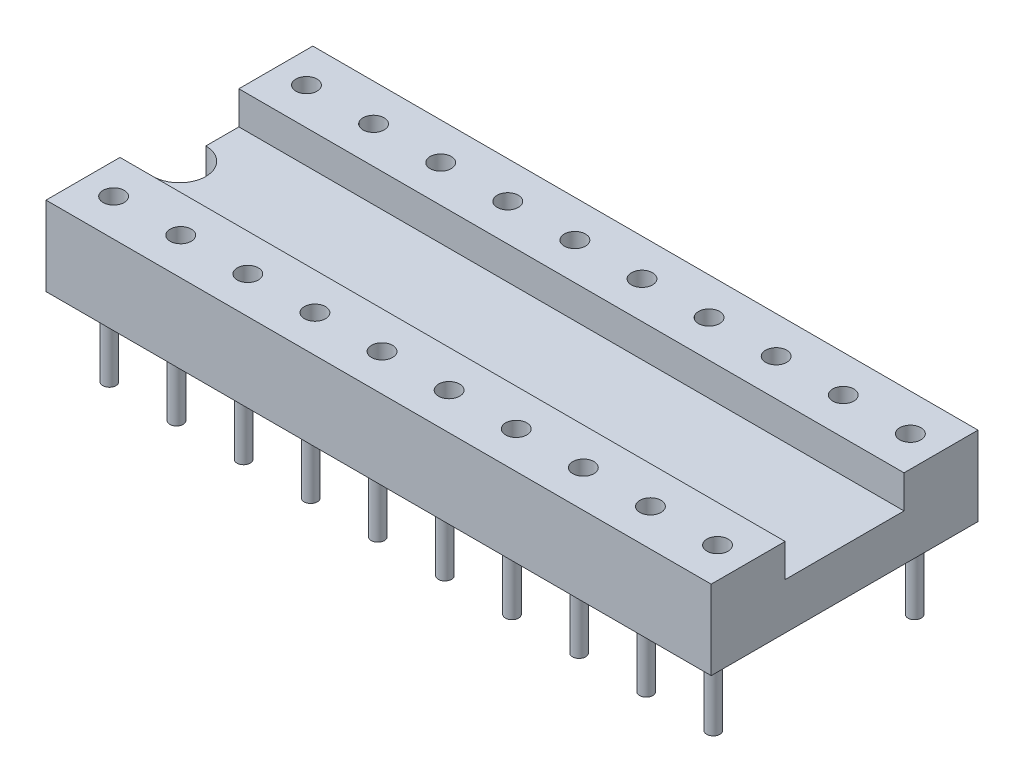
from build123d import *

# Parameters (mm, degrees)
EXTRUSION1_DEPTH        = 25.18
ENL_V_MAT_EXTRU_1_DEPTH = 26.740967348
ESQUISSE3_R             = 0.4
ENL_V_MAT_EXTRU_2_DEPTH = 2.5
ESQUISSE5_R             = 0.25
EXTRUSION2_DEPTH        = 3


with BuildPart() as part:
    # Esquisse1 → Extrusion1 (new body)
    with BuildSketch(Plane(origin=(0, 0, 0), x_dir=(0, 0, -1), z_dir=(1, 0, 0))):
        Polygon((-2.25, 1.75), (-2.25, 3), (-5.05, 3), (-5.05, 0), (5.05, 0), (5.05, 3), (2.25, 3), (2.25, 1.75), align=None)
    extrude(amount=EXTRUSION1_DEPTH)

    # Esquisse2 → Enl_v. mat.-Extru.1 (cut, through all)
    with BuildSketch(Plane(origin=(0, 1.75, 0), x_dir=(-1, 0, 0), z_dir=(0, 1, 0))):
        with BuildLine():
            Line((0, -1), (0, 1))
            ThreePointArc((0, 1), (-1, 0), (0, -1))
        make_face()
    extrude(amount=-ENL_V_MAT_EXTRU_1_DEPTH, mode=Mode.SUBTRACT)

    # Esquisse3 → Enl_v. mat.-Extru.2 (cut)
    with BuildSketch(Plane(origin=(0, 3, 0), x_dir=(-1, 0, 0), z_dir=(0, 1, 0))):
        with Locations(Location((-1.16, 3.65, 0), (0, 0, 90))):
            Circle(ESQUISSE3_R)
        with Locations(Location((-1.16, -3.65, 0), (0, 0, 270))):
            Circle(ESQUISSE3_R)
        with Locations(Location((-3.7, 3.65, 0), (0, 0, 90))):
            Circle(ESQUISSE3_R)
        with Locations(Location((-3.7, -3.65, 0), (0, 0, 270))):
            Circle(ESQUISSE3_R)
        with Locations(Location((-6.24, 3.65, 0), (0, 0, 90))):
            Circle(ESQUISSE3_R)
        with Locations(Location((-6.24, -3.65, 0), (0, 0, 270))):
            Circle(ESQUISSE3_R)
        with Locations(Location((-8.78, 3.65, 0), (0, 0, 90))):
            Circle(ESQUISSE3_R)
        with Locations(Location((-8.78, -3.65, 0), (0, 0, 270))):
            Circle(ESQUISSE3_R)
        with Locations(Location((-11.32, 3.65, 0), (0, 0, 90))):
            Circle(ESQUISSE3_R)
        with Locations(Location((-11.32, -3.65, 0), (0, 0, 270))):
            Circle(ESQUISSE3_R)
        with Locations(Location((-13.86, 3.65, 0), (0, 0, 90))):
            Circle(ESQUISSE3_R)
        with Locations(Location((-13.86, -3.65, 0), (0, 0, 270))):
            Circle(ESQUISSE3_R)
        with Locations(Location((-16.4, 3.65, 0), (0, 0, 90))):
            Circle(ESQUISSE3_R)
        with Locations(Location((-16.4, -3.65, 0), (0, 0, 270))):
            Circle(ESQUISSE3_R)
        with Locations(Location((-18.94, 3.65, 0), (0, 0, 90))):
            Circle(ESQUISSE3_R)
        with Locations(Location((-18.94, -3.65, 0), (0, 0, 270))):
            Circle(ESQUISSE3_R)
        with Locations(Location((-21.48, 3.65, 0), (0, 0, 90))):
            Circle(ESQUISSE3_R)
        with Locations(Location((-21.48, -3.65, 0), (0, 0, 270))):
            Circle(ESQUISSE3_R)
        with Locations(Location((-24.02, 3.65, 0), (0, 0, 90))):
            Circle(ESQUISSE3_R)
        with Locations(Location((-24.02, -3.65, 0), (0, 0, 270))):
            Circle(ESQUISSE3_R)
    extrude(amount=-ENL_V_MAT_EXTRU_2_DEPTH, mode=Mode.SUBTRACT)

    # Esquisse5 → Extrusion2 (add)
    with BuildSketch(Plane.XZ):
        with Locations(Location((1.16, 3.81, 0), (0, 0, 90))):
            Circle(ESQUISSE5_R)
        with Locations(Location((1.16, -3.81, 0), (0, 0, 90))):
            Circle(ESQUISSE5_R)
        with Locations(Location((3.7, -3.81, 0), (0, 0, 90))):
            Circle(ESQUISSE5_R)
        with Locations(Location((3.7, 3.81, 0), (0, 0, 90))):
            Circle(ESQUISSE5_R)
        with Locations(Location((6.24, -3.81, 0), (0, 0, 90))):
            Circle(ESQUISSE5_R)
        with Locations(Location((6.24, 3.81, 0), (0, 0, 90))):
            Circle(ESQUISSE5_R)
        with Locations(Location((8.78, -3.81, 0), (0, 0, 90))):
            Circle(ESQUISSE5_R)
        with Locations(Location((8.78, 3.81, 0), (0, 0, 90))):
            Circle(ESQUISSE5_R)
        with Locations(Location((11.32, -3.81, 0), (0, 0, 90))):
            Circle(ESQUISSE5_R)
        with Locations(Location((11.32, 3.81, 0), (0, 0, 90))):
            Circle(ESQUISSE5_R)
        with Locations(Location((13.86, -3.81, 0), (0, 0, 90))):
            Circle(ESQUISSE5_R)
        with Locations(Location((13.86, 3.81, 0), (0, 0, 90))):
            Circle(ESQUISSE5_R)
        with Locations(Location((16.4, -3.81, 0), (0, 0, 90))):
            Circle(ESQUISSE5_R)
        with Locations(Location((16.4, 3.81, 0), (0, 0, 90))):
            Circle(ESQUISSE5_R)
        with Locations(Location((18.94, -3.81, 0), (0, 0, 90))):
            Circle(ESQUISSE5_R)
        with Locations(Location((18.94, 3.81, 0), (0, 0, 90))):
            Circle(ESQUISSE5_R)
        with Locations(Location((21.48, -3.81, 0), (0, 0, 90))):
            Circle(ESQUISSE5_R)
        with Locations(Location((21.48, 3.81, 0), (0, 0, 90))):
            Circle(ESQUISSE5_R)
        with Locations(Location((24.02, -3.81, 0), (0, 0, 90))):
            Circle(ESQUISSE5_R)
        with Locations(Location((24.02, 3.81, 0), (0, 0, 90))):
            Circle(ESQUISSE5_R)
    extrude(amount=EXTRUSION2_DEPTH)


solid = part.part
